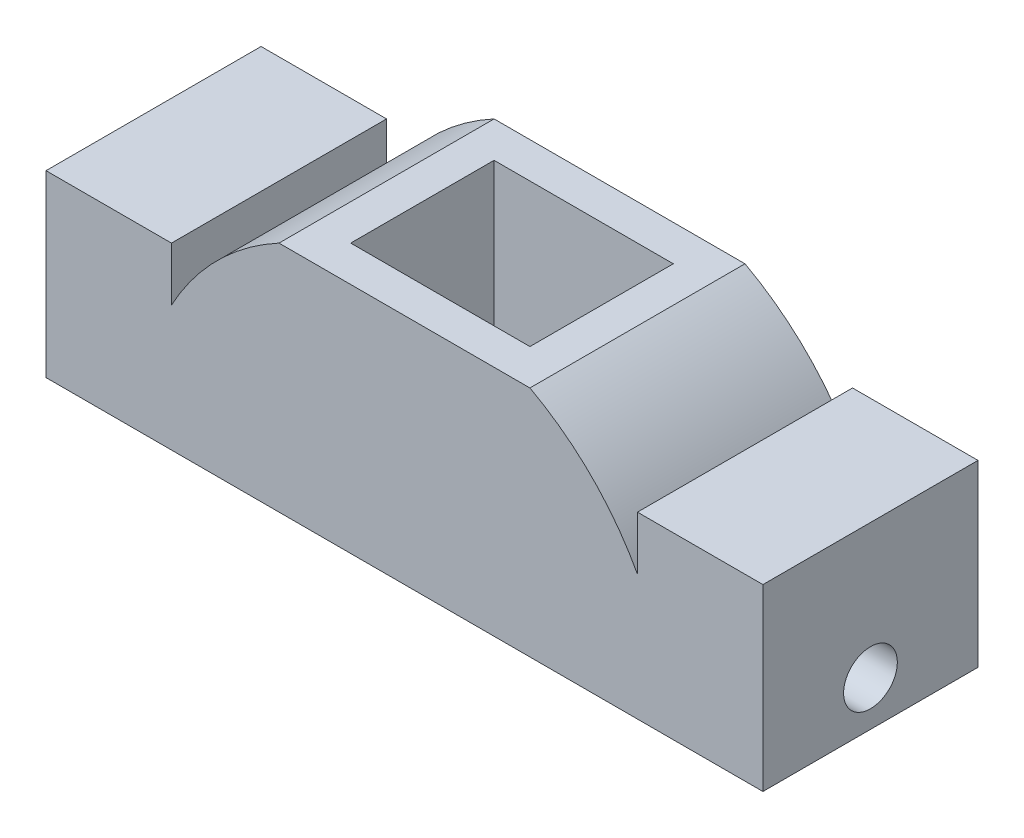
from build123d import *

# Parameters (mm, degrees)
EXTRUDE1_DEPTH     = 60
SKETCH2_W          = 50
SKETCH2_H          = 40
CUT_EXTRUDE1_DEPTH = 60
SKETCH3_R          = 7.5
CUT_EXTRUDE2_DEPTH = 219.689277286


with BuildPart() as part:
    # Sketch1 → Extrude1 (new body)
    with BuildSketch(Plane.XY):
        with BuildLine():
            Line((-65, 50), (-65, 35))
            ThreePointArc((-65, 35), (-52.201532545, 52.201532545), (-35, 65))
            Line((-35, 65), (35, 65))
            ThreePointArc((35, 65), (52.201532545, 52.201532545), (65, 35))
            Line((65, 35), (65, 50))
            Line((65, 50), (100, 50))
            Line((100, 50), (100, 0))
            Line((100, 0), (-100, 0))
            Line((-100, 0), (-100, 50))
            Line((-100, 50), (-65, 50))
        make_face()
    extrude(amount=EXTRUDE1_DEPTH)

    # Sketch2 → Cut-Extrude1 (cut)
    with BuildSketch(Plane(origin=(0, 65, 0), x_dir=(-1, 0, 0), z_dir=(0, 1, 0))):
        with Locations((0, 30)):
            Rectangle(SKETCH2_W, SKETCH2_H)
    extrude(amount=-CUT_EXTRUDE1_DEPTH, mode=Mode.SUBTRACT)

    # Sketch3 → Cut-Extrude2 (cut, through all)
    with BuildSketch(Plane(origin=(100, 0, 0), x_dir=(0, 0, -1), z_dir=(1, 0, 0))):
        with Locations((-30, 12.5)):
            Circle(SKETCH3_R)
    extrude(amount=-CUT_EXTRUDE2_DEPTH, mode=Mode.SUBTRACT)


solid = part.part
